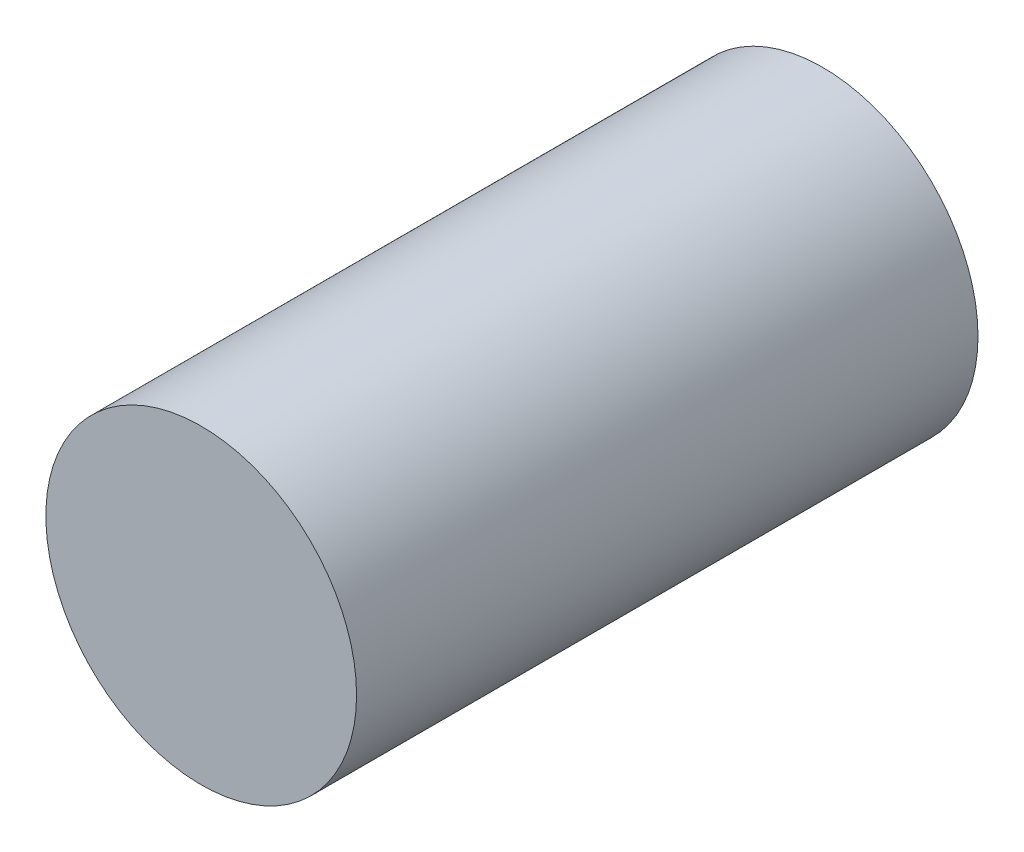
from build123d import *

# Parameters (mm, degrees)
SKETCH1_R      = 25.4
EXTRUDE1_DEPTH = 101.6


with BuildPart() as part:
    # Sketch1 → Extrude1 (new body)
    with BuildSketch(Plane.XY):
        Circle(SKETCH1_R)
    extrude(amount=EXTRUDE1_DEPTH)


solid = part.part
